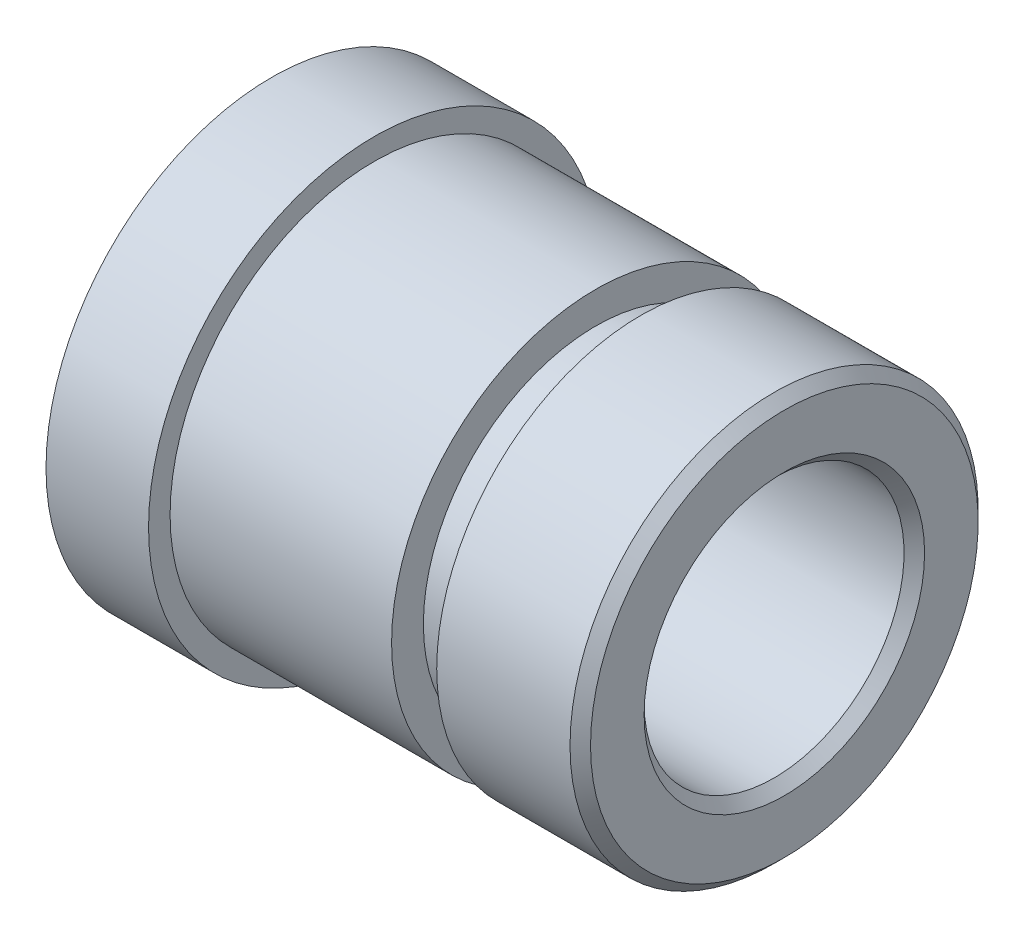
ISO-10303-21;
HEADER;
FILE_DESCRIPTION(('STEP AP214'),'2;1');
FILE_NAME('part.step','',(''),(''),'','','');
FILE_SCHEMA(('AUTOMOTIVE_DESIGN { 1 0 10303 214 1 1 1 1 }'));
ENDSEC;
DATA;
#1=APPLICATION_CONTEXT('core data for automotive mechanical design processes');
#2=APPLICATION_PROTOCOL_DEFINITION('international standard','automotive_design',2000,#1);
#3=PRODUCT_CONTEXT('',#1,'mechanical');
#4=PRODUCT('Part','Part','',(#3));
#5=PRODUCT_RELATED_PRODUCT_CATEGORY('part','',(#4));
#6=PRODUCT_DEFINITION_FORMATION('','',#4);
#7=PRODUCT_DEFINITION_CONTEXT('part definition',#1,'design');
#8=PRODUCT_DEFINITION('design','',#6,#7);
#9=PRODUCT_DEFINITION_SHAPE('','',#8);
#10=(LENGTH_UNIT() NAMED_UNIT(*) SI_UNIT(.MILLI.,.METRE.));
#11=(NAMED_UNIT(*) PLANE_ANGLE_UNIT() SI_UNIT($,.RADIAN.));
#12=(NAMED_UNIT(*) SI_UNIT($,.STERADIAN.) SOLID_ANGLE_UNIT());
#13=UNCERTAINTY_MEASURE_WITH_UNIT(LENGTH_MEASURE(1.E-05),#10,'distance_accuracy_value','');
#14=(GEOMETRIC_REPRESENTATION_CONTEXT(3) GLOBAL_UNCERTAINTY_ASSIGNED_CONTEXT((#13)) GLOBAL_UNIT_ASSIGNED_CONTEXT((#10,
#11,#12)) REPRESENTATION_CONTEXT('',''));
#15=CARTESIAN_POINT('',(0.,0.,0.));
#16=DIRECTION('',(0.,0.,1.));
#17=DIRECTION('',(1.,0.,0.));
#18=AXIS2_PLACEMENT_3D('',#15,#16,#17);
#19=CARTESIAN_POINT('',(0.,22.,0.));
#20=DIRECTION('',(1.,0.,0.));
#21=DIRECTION('',(0.,0.,-1.));
#22=AXIS2_PLACEMENT_3D('',#19,#20,#21);
#23=PLANE('',#22);
#24=CARTESIAN_POINT('',(0.,0.,0.));
#25=DIRECTION('',(-1.,0.,0.));
#26=DIRECTION('',(0.,0.,1.));
#27=AXIS2_PLACEMENT_3D('',#24,#25,#26);
#28=CIRCLE('',#27,15.575);
#29=CARTESIAN_POINT('',(0.,0.,15.575));
#30=VERTEX_POINT('',#29);
#31=EDGE_CURVE('E57',#30,#30,#28,.T.);
#32=ORIENTED_EDGE('',*,*,#31,.F.);
#33=EDGE_LOOP('',(#32));
#34=FACE_BOUND('',#33,.T.);
#35=CARTESIAN_POINT('',(0.,0.,0.));
#36=DIRECTION('',(-1.,0.,0.));
#37=DIRECTION('',(0.,0.,1.));
#38=AXIS2_PLACEMENT_3D('',#35,#36,#37);
#39=CIRCLE('',#38,22.);
#40=CARTESIAN_POINT('',(0.,0.,22.));
#41=VERTEX_POINT('',#40);
#42=EDGE_CURVE('E53',#41,#41,#39,.T.);
#43=ORIENTED_EDGE('',*,*,#42,.T.);
#44=EDGE_LOOP('',(#43));
#45=FACE_BOUND('',#44,.T.);
#46=ADVANCED_FACE('F15',(#34,#45),#23,.F.);
#47=CARTESIAN_POINT('',(50.,19.9,0.));
#48=DIRECTION('',(-1.,0.,0.));
#49=DIRECTION('',(0.,0.,1.));
#50=AXIS2_PLACEMENT_3D('',#47,#48,#49);
#51=PLANE('',#50);
#52=CARTESIAN_POINT('',(50.,0.,0.));
#53=DIRECTION('',(-1.,0.,0.));
#54=DIRECTION('',(0.,0.,1.));
#55=AXIS2_PLACEMENT_3D('',#52,#53,#54);
#56=CIRCLE('',#55,18.9);
#57=CARTESIAN_POINT('',(50.,0.,18.9));
#58=VERTEX_POINT('',#57);
#59=EDGE_CURVE('E22',#58,#58,#56,.F.);
#60=ORIENTED_EDGE('',*,*,#59,.T.);
#61=EDGE_LOOP('',(#60));
#62=FACE_BOUND('',#61,.T.);
#63=CARTESIAN_POINT('',(50.,0.,0.));
#64=DIRECTION('',(-1.,0.,0.));
#65=DIRECTION('',(0.,0.,1.));
#66=AXIS2_PLACEMENT_3D('',#63,#64,#65);
#67=CIRCLE('',#66,13.675);
#68=CARTESIAN_POINT('',(50.,0.,13.675));
#69=VERTEX_POINT('',#68);
#70=EDGE_CURVE('E26',#69,#69,#67,.T.);
#71=ORIENTED_EDGE('',*,*,#70,.T.);
#72=EDGE_LOOP('',(#71));
#73=FACE_BOUND('',#72,.T.);
#74=ADVANCED_FACE('F83',(#62,#73),#51,.F.);
#75=CARTESIAN_POINT('',(-38.03626097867,0.,0.));
#76=DIRECTION('',(-1.,0.,0.));
#77=DIRECTION('',(0.,0.,1.));
#78=AXIS2_PLACEMENT_3D('',#75,#76,#77);
#79=CYLINDRICAL_SURFACE('',#78,19.9);
#80=CARTESIAN_POINT('',(49.,0.,0.));
#81=DIRECTION('',(-1.,0.,0.));
#82=DIRECTION('',(0.,0.,1.));
#83=AXIS2_PLACEMENT_3D('',#80,#81,#82);
#84=CIRCLE('',#83,19.9);
#85=CARTESIAN_POINT('',(49.,0.,19.9));
#86=VERTEX_POINT('',#85);
#87=EDGE_CURVE('E30',#86,#86,#84,.T.);
#88=ORIENTED_EDGE('',*,*,#87,.T.);
#89=EDGE_LOOP('',(#88));
#90=FACE_BOUND('',#89,.T.);
#91=CARTESIAN_POINT('',(36.,0.,0.));
#92=DIRECTION('',(-1.,0.,0.));
#93=DIRECTION('',(0.,0.,1.));
#94=AXIS2_PLACEMENT_3D('',#91,#92,#93);
#95=CIRCLE('',#94,19.9);
#96=CARTESIAN_POINT('',(36.,0.,19.9));
#97=VERTEX_POINT('',#96);
#98=EDGE_CURVE('E35',#97,#97,#95,.T.);
#99=ORIENTED_EDGE('',*,*,#98,.F.);
#100=EDGE_LOOP('',(#99));
#101=FACE_BOUND('',#100,.T.);
#102=ADVANCED_FACE('F119',(#90,#101),#79,.T.);
#103=CARTESIAN_POINT('',(36.,16.8,0.));
#104=DIRECTION('',(1.,0.,0.));
#105=DIRECTION('',(0.,0.,-1.));
#106=AXIS2_PLACEMENT_3D('',#103,#104,#105);
#107=PLANE('',#106);
#108=CARTESIAN_POINT('',(36.,0.,0.));
#109=DIRECTION('',(-1.,0.,0.));
#110=DIRECTION('',(0.,0.,1.));
#111=AXIS2_PLACEMENT_3D('',#108,#109,#110);
#112=CIRCLE('',#111,16.8);
#113=CARTESIAN_POINT('',(36.,0.,16.8));
#114=VERTEX_POINT('',#113);
#115=EDGE_CURVE('E38',#114,#114,#112,.T.);
#116=ORIENTED_EDGE('',*,*,#115,.F.);
#117=EDGE_LOOP('',(#116));
#118=FACE_BOUND('',#117,.T.);
#119=ORIENTED_EDGE('',*,*,#98,.T.);
#120=EDGE_LOOP('',(#119));
#121=FACE_BOUND('',#120,.T.);
#122=ADVANCED_FACE('F113',(#118,#121),#107,.F.);
#123=CARTESIAN_POINT('',(-38.03626097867,0.,0.));
#124=DIRECTION('',(-1.,0.,0.));
#125=DIRECTION('',(0.,0.,1.));
#126=AXIS2_PLACEMENT_3D('',#123,#124,#125);
#127=CYLINDRICAL_SURFACE('',#126,16.8);
#128=CARTESIAN_POINT('',(31.6,0.,0.));
#129=DIRECTION('',(-1.,0.,0.));
#130=DIRECTION('',(0.,0.,1.));
#131=AXIS2_PLACEMENT_3D('',#128,#129,#130);
#132=CIRCLE('',#131,16.8);
#133=CARTESIAN_POINT('',(31.6,0.,16.8));
#134=VERTEX_POINT('',#133);
#135=EDGE_CURVE('E41',#134,#134,#132,.T.);
#136=ORIENTED_EDGE('',*,*,#135,.F.);
#137=EDGE_LOOP('',(#136));
#138=FACE_BOUND('',#137,.T.);
#139=ORIENTED_EDGE('',*,*,#115,.T.);
#140=EDGE_LOOP('',(#139));
#141=FACE_BOUND('',#140,.T.);
#142=ADVANCED_FACE('F107',(#138,#141),#127,.T.);
#143=CARTESIAN_POINT('',(31.6,19.9,0.));
#144=DIRECTION('',(-1.,0.,0.));
#145=DIRECTION('',(0.,0.,1.));
#146=AXIS2_PLACEMENT_3D('',#143,#144,#145);
#147=PLANE('',#146);
#148=CARTESIAN_POINT('',(31.6,0.,0.));
#149=DIRECTION('',(-1.,0.,0.));
#150=DIRECTION('',(0.,0.,1.));
#151=AXIS2_PLACEMENT_3D('',#148,#149,#150);
#152=CIRCLE('',#151,19.9);
#153=CARTESIAN_POINT('',(31.6,0.,19.9));
#154=VERTEX_POINT('',#153);
#155=EDGE_CURVE('E44',#154,#154,#152,.T.);
#156=ORIENTED_EDGE('',*,*,#155,.F.);
#157=EDGE_LOOP('',(#156));
#158=FACE_BOUND('',#157,.T.);
#159=ORIENTED_EDGE('',*,*,#135,.T.);
#160=EDGE_LOOP('',(#159));
#161=FACE_BOUND('',#160,.T.);
#162=ADVANCED_FACE('F101',(#158,#161),#147,.F.);
#163=CARTESIAN_POINT('',(-38.03626097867,0.,0.));
#164=DIRECTION('',(-1.,0.,0.));
#165=DIRECTION('',(0.,0.,1.));
#166=AXIS2_PLACEMENT_3D('',#163,#164,#165);
#167=CYLINDRICAL_SURFACE('',#166,19.9);
#168=CARTESIAN_POINT('',(10.,0.,0.));
#169=DIRECTION('',(-1.,0.,0.));
#170=DIRECTION('',(0.,0.,1.));
#171=AXIS2_PLACEMENT_3D('',#168,#169,#170);
#172=CIRCLE('',#171,19.9);
#173=CARTESIAN_POINT('',(10.,0.,19.9));
#174=VERTEX_POINT('',#173);
#175=EDGE_CURVE('E47',#174,#174,#172,.T.);
#176=ORIENTED_EDGE('',*,*,#175,.F.);
#177=EDGE_LOOP('',(#176));
#178=FACE_BOUND('',#177,.T.);
#179=ORIENTED_EDGE('',*,*,#155,.T.);
#180=EDGE_LOOP('',(#179));
#181=FACE_BOUND('',#180,.T.);
#182=ADVANCED_FACE('F95',(#178,#181),#167,.T.);
#183=CARTESIAN_POINT('',(10.,22.,0.));
#184=DIRECTION('',(-1.,0.,0.));
#185=DIRECTION('',(0.,0.,1.));
#186=AXIS2_PLACEMENT_3D('',#183,#184,#185);
#187=PLANE('',#186);
#188=CARTESIAN_POINT('',(10.,0.,0.));
#189=DIRECTION('',(-1.,0.,0.));
#190=DIRECTION('',(0.,0.,1.));
#191=AXIS2_PLACEMENT_3D('',#188,#189,#190);
#192=CIRCLE('',#191,22.);
#193=CARTESIAN_POINT('',(10.,0.,22.));
#194=VERTEX_POINT('',#193);
#195=EDGE_CURVE('E50',#194,#194,#192,.T.);
#196=ORIENTED_EDGE('',*,*,#195,.F.);
#197=EDGE_LOOP('',(#196));
#198=FACE_BOUND('',#197,.T.);
#199=ORIENTED_EDGE('',*,*,#175,.T.);
#200=EDGE_LOOP('',(#199));
#201=FACE_BOUND('',#200,.T.);
#202=ADVANCED_FACE('F89',(#198,#201),#187,.F.);
#203=CARTESIAN_POINT('',(-38.03626097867,0.,0.));
#204=DIRECTION('',(-1.,0.,0.));
#205=DIRECTION('',(0.,0.,1.));
#206=AXIS2_PLACEMENT_3D('',#203,#204,#205);
#207=CYLINDRICAL_SURFACE('',#206,22.);
#208=ORIENTED_EDGE('',*,*,#42,.F.);
#209=EDGE_LOOP('',(#208));
#210=FACE_BOUND('',#209,.T.);
#211=ORIENTED_EDGE('',*,*,#195,.T.);
#212=EDGE_LOOP('',(#211));
#213=FACE_BOUND('',#212,.T.);
#214=ADVANCED_FACE('F77',(#210,#213),#207,.T.);
#215=CARTESIAN_POINT('',(4.8,0.,0.));
#216=DIRECTION('',(-1.,0.,0.));
#217=DIRECTION('',(0.,0.,1.));
#218=AXIS2_PLACEMENT_3D('',#215,#216,#217);
#219=CYLINDRICAL_SURFACE('',#218,15.575);
#220=CARTESIAN_POINT('',(4.8,0.,0.));
#221=DIRECTION('',(-1.,0.,0.));
#222=DIRECTION('',(0.,0.,1.));
#223=AXIS2_PLACEMENT_3D('',#220,#221,#222);
#224=CIRCLE('',#223,15.575);
#225=CARTESIAN_POINT('',(4.8,0.,15.575));
#226=VERTEX_POINT('',#225);
#227=EDGE_CURVE('E56',#226,#226,#224,.T.);
#228=ORIENTED_EDGE('',*,*,#227,.F.);
#229=EDGE_LOOP('',(#228));
#230=FACE_BOUND('',#229,.T.);
#231=ORIENTED_EDGE('',*,*,#31,.T.);
#232=EDGE_LOOP('',(#231));
#233=FACE_BOUND('',#232,.T.);
#234=ADVANCED_FACE('F71',(#230,#233),#219,.F.);
#235=CARTESIAN_POINT('',(4.8,0.,0.));
#236=DIRECTION('',(-1.,0.,0.));
#237=DIRECTION('',(0.,0.,1.));
#238=AXIS2_PLACEMENT_3D('',#235,#236,#237);
#239=PLANE('',#238);
#240=CARTESIAN_POINT('',(4.8,0.,0.));
#241=DIRECTION('',(-1.,0.,0.));
#242=DIRECTION('',(0.,0.,1.));
#243=AXIS2_PLACEMENT_3D('',#240,#241,#242);
#244=CIRCLE('',#243,12.675);
#245=CARTESIAN_POINT('',(4.8,0.,12.675));
#246=VERTEX_POINT('',#245);
#247=EDGE_CURVE('E60',#246,#246,#244,.T.);
#248=ORIENTED_EDGE('',*,*,#247,.F.);
#249=EDGE_LOOP('',(#248));
#250=FACE_BOUND('',#249,.T.);
#251=ORIENTED_EDGE('',*,*,#227,.T.);
#252=EDGE_LOOP('',(#251));
#253=FACE_BOUND('',#252,.T.);
#254=ADVANCED_FACE('F68',(#250,#253),#239,.T.);
#255=CARTESIAN_POINT('',(50.,0.,0.));
#256=DIRECTION('',(-1.,0.,0.));
#257=DIRECTION('',(0.,0.,1.));
#258=AXIS2_PLACEMENT_3D('',#255,#256,#257);
#259=CYLINDRICAL_SURFACE('',#258,12.675);
#260=CARTESIAN_POINT('',(49.,0.,0.));
#261=DIRECTION('',(-1.,0.,0.));
#262=DIRECTION('',(0.,0.,1.));
#263=AXIS2_PLACEMENT_3D('',#260,#261,#262);
#264=CIRCLE('',#263,12.675);
#265=CARTESIAN_POINT('',(49.,0.,12.675));
#266=VERTEX_POINT('',#265);
#267=EDGE_CURVE('E10',#266,#266,#264,.F.);
#268=ORIENTED_EDGE('',*,*,#267,.T.);
#269=EDGE_LOOP('',(#268));
#270=FACE_BOUND('',#269,.T.);
#271=ORIENTED_EDGE('',*,*,#247,.T.);
#272=EDGE_LOOP('',(#271));
#273=FACE_BOUND('',#272,.T.);
#274=ADVANCED_FACE('F66',(#270,#273),#259,.F.);
#275=CARTESIAN_POINT('',(49.,0.,0.));
#276=DIRECTION('',(-1.,0.,0.));
#277=DIRECTION('',(0.,0.,1.));
#278=AXIS2_PLACEMENT_3D('',#275,#276,#277);
#279=CONICAL_SURFACE('',#278,19.9,0.785398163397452);
#280=ORIENTED_EDGE('',*,*,#59,.F.);
#281=EDGE_LOOP('',(#280));
#282=FACE_BOUND('',#281,.T.);
#283=ORIENTED_EDGE('',*,*,#87,.F.);
#284=EDGE_LOOP('',(#283));
#285=FACE_BOUND('',#284,.T.);
#286=ADVANCED_FACE('F132',(#282,#285),#279,.T.);
#287=CARTESIAN_POINT('',(50.,0.,0.));
#288=DIRECTION('',(1.,0.,0.));
#289=DIRECTION('',(0.,0.,-1.));
#290=AXIS2_PLACEMENT_3D('',#287,#288,#289);
#291=CONICAL_SURFACE('',#290,13.675,0.785398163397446);
#292=ORIENTED_EDGE('',*,*,#267,.F.);
#293=EDGE_LOOP('',(#292));
#294=FACE_BOUND('',#293,.T.);
#295=ORIENTED_EDGE('',*,*,#70,.F.);
#296=EDGE_LOOP('',(#295));
#297=FACE_BOUND('',#296,.T.);
#298=ADVANCED_FACE('F17',(#294,#297),#291,.F.);
#299=CLOSED_SHELL('',(#46,#74,#102,#122,#142,#162,#182,#202,#214,#234,#254,#274,#286,#298));
#300=MANIFOLD_SOLID_BREP('B1',#299);
#301=ADVANCED_BREP_SHAPE_REPRESENTATION('',(#18,#300),#14);
#302=SHAPE_DEFINITION_REPRESENTATION(#9,#301);
ENDSEC;
END-ISO-10303-21;
